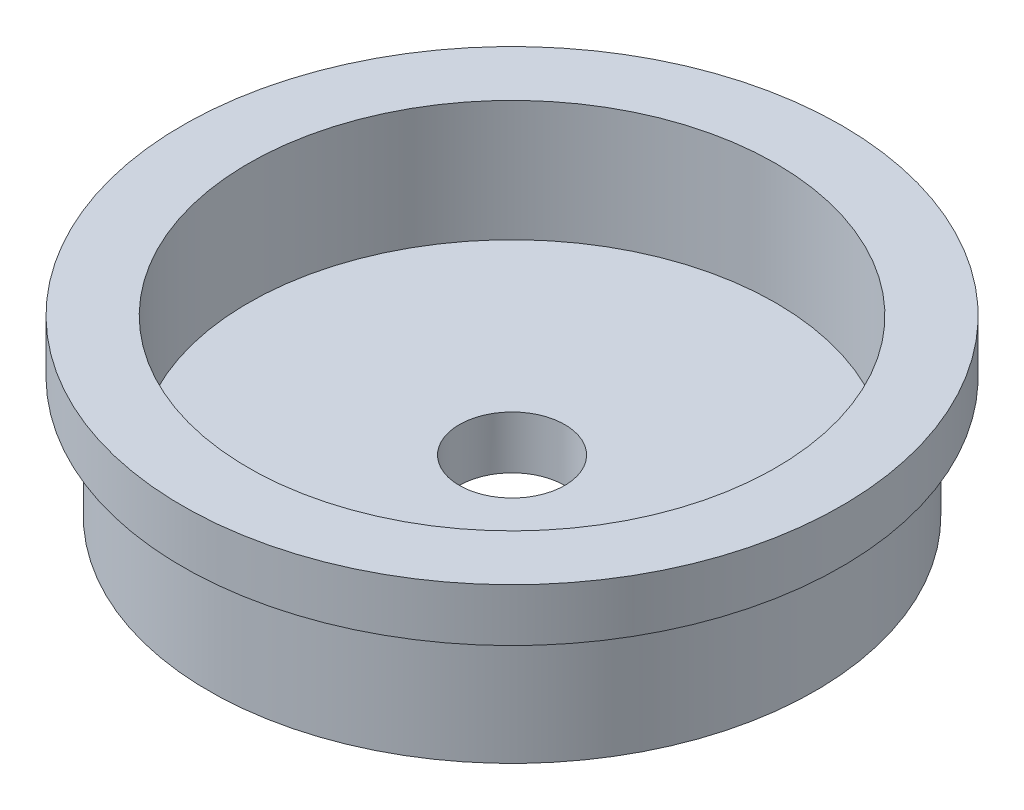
ISO-10303-21;
HEADER;
FILE_DESCRIPTION(('STEP AP214'),'2;1');
FILE_NAME('part.step','',(''),(''),'','','');
FILE_SCHEMA(('AUTOMOTIVE_DESIGN { 1 0 10303 214 1 1 1 1 }'));
ENDSEC;
DATA;
#1=APPLICATION_CONTEXT('core data for automotive mechanical design processes');
#2=APPLICATION_PROTOCOL_DEFINITION('international standard','automotive_design',2000,#1);
#3=PRODUCT_CONTEXT('',#1,'mechanical');
#4=PRODUCT('Part','Part','',(#3));
#5=PRODUCT_RELATED_PRODUCT_CATEGORY('part','',(#4));
#6=PRODUCT_DEFINITION_FORMATION('','',#4);
#7=PRODUCT_DEFINITION_CONTEXT('part definition',#1,'design');
#8=PRODUCT_DEFINITION('design','',#6,#7);
#9=PRODUCT_DEFINITION_SHAPE('','',#8);
#10=(LENGTH_UNIT() NAMED_UNIT(*) SI_UNIT(.MILLI.,.METRE.));
#11=(NAMED_UNIT(*) PLANE_ANGLE_UNIT() SI_UNIT($,.RADIAN.));
#12=(NAMED_UNIT(*) SI_UNIT($,.STERADIAN.) SOLID_ANGLE_UNIT());
#13=UNCERTAINTY_MEASURE_WITH_UNIT(LENGTH_MEASURE(1.E-05),#10,'distance_accuracy_value','');
#14=(GEOMETRIC_REPRESENTATION_CONTEXT(3) GLOBAL_UNCERTAINTY_ASSIGNED_CONTEXT((#13)) GLOBAL_UNIT_ASSIGNED_CONTEXT((#10,
#11,#12)) REPRESENTATION_CONTEXT('',''));
#15=CARTESIAN_POINT('',(0.,0.,0.));
#16=DIRECTION('',(0.,0.,1.));
#17=DIRECTION('',(1.,0.,0.));
#18=AXIS2_PLACEMENT_3D('',#15,#16,#17);
#19=CARTESIAN_POINT('',(0.,0.,0.));
#20=DIRECTION('',(0.,-1.,0.));
#21=DIRECTION('',(0.,0.,-1.));
#22=AXIS2_PLACEMENT_3D('',#19,#20,#21);
#23=PLANE('',#22);
#24=CARTESIAN_POINT('',(0.,0.,0.));
#25=DIRECTION('',(0.,-1.,0.));
#26=DIRECTION('',(0.,0.,-1.));
#27=AXIS2_PLACEMENT_3D('',#24,#25,#26);
#28=CIRCLE('',#27,1.);
#29=CARTESIAN_POINT('',(0.,0.,-1.));
#30=VERTEX_POINT('',#29);
#31=EDGE_CURVE('E36',#30,#30,#28,.T.);
#32=ORIENTED_EDGE('',*,*,#31,.F.);
#33=EDGE_LOOP('',(#32));
#34=FACE_BOUND('',#33,.T.);
#35=CARTESIAN_POINT('',(0.,0.,0.));
#36=DIRECTION('',(0.,-1.,0.));
#37=DIRECTION('',(0.,0.,-1.));
#38=AXIS2_PLACEMENT_3D('',#35,#36,#37);
#39=CIRCLE('',#38,5.75);
#40=CARTESIAN_POINT('',(0.,0.,-5.75));
#41=VERTEX_POINT('',#40);
#42=EDGE_CURVE('E10',#41,#41,#39,.T.);
#43=ORIENTED_EDGE('',*,*,#42,.T.);
#44=EDGE_LOOP('',(#43));
#45=FACE_BOUND('',#44,.T.);
#46=ADVANCED_FACE('F33',(#34,#45),#23,.T.);
#47=CARTESIAN_POINT('',(0.,0.,0.));
#48=DIRECTION('',(0.,-1.,0.));
#49=DIRECTION('',(0.,0.,-1.));
#50=AXIS2_PLACEMENT_3D('',#47,#48,#49);
#51=CYLINDRICAL_SURFACE('',#50,5.75);
#52=CARTESIAN_POINT('',(0.,2.,0.));
#53=DIRECTION('',(0.,-1.,0.));
#54=DIRECTION('',(0.,0.,-1.));
#55=AXIS2_PLACEMENT_3D('',#52,#53,#54);
#56=CIRCLE('',#55,5.75);
#57=CARTESIAN_POINT('',(0.,2.,-5.75));
#58=VERTEX_POINT('',#57);
#59=EDGE_CURVE('E40',#58,#58,#56,.T.);
#60=ORIENTED_EDGE('',*,*,#59,.T.);
#61=EDGE_LOOP('',(#60));
#62=FACE_BOUND('',#61,.T.);
#63=ORIENTED_EDGE('',*,*,#42,.F.);
#64=EDGE_LOOP('',(#63));
#65=FACE_BOUND('',#64,.T.);
#66=ADVANCED_FACE('F68',(#62,#65),#51,.T.);
#67=CARTESIAN_POINT('',(0.,2.,0.));
#68=DIRECTION('',(0.,1.,0.));
#69=DIRECTION('',(0.,0.,1.));
#70=AXIS2_PLACEMENT_3D('',#67,#68,#69);
#71=CONICAL_SURFACE('',#70,5.75,1.04670527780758);
#72=CARTESIAN_POINT('',(0.,2.28900341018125,0.));
#73=DIRECTION('',(0.,-1.,0.));
#74=DIRECTION('',(0.,0.,-1.));
#75=AXIS2_PLACEMENT_3D('',#72,#73,#74);
#76=CIRCLE('',#75,6.25);
#77=CARTESIAN_POINT('',(0.,2.28900341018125,-6.25));
#78=VERTEX_POINT('',#77);
#79=EDGE_CURVE('E44',#78,#78,#76,.T.);
#80=ORIENTED_EDGE('',*,*,#79,.T.);
#81=EDGE_LOOP('',(#80));
#82=FACE_BOUND('',#81,.T.);
#83=ORIENTED_EDGE('',*,*,#59,.F.);
#84=EDGE_LOOP('',(#83));
#85=FACE_BOUND('',#84,.T.);
#86=ADVANCED_FACE('F72',(#82,#85),#71,.T.);
#87=CARTESIAN_POINT('',(0.,0.,0.));
#88=DIRECTION('',(0.,-1.,0.));
#89=DIRECTION('',(0.,0.,-1.));
#90=AXIS2_PLACEMENT_3D('',#87,#88,#89);
#91=CYLINDRICAL_SURFACE('',#90,6.25);
#92=CARTESIAN_POINT('',(0.,3.28900341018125,0.));
#93=DIRECTION('',(0.,-1.,0.));
#94=DIRECTION('',(0.,0.,-1.));
#95=AXIS2_PLACEMENT_3D('',#92,#93,#94);
#96=CIRCLE('',#95,6.25);
#97=CARTESIAN_POINT('',(0.,3.28900341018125,-6.25));
#98=VERTEX_POINT('',#97);
#99=EDGE_CURVE('E49',#98,#98,#96,.T.);
#100=ORIENTED_EDGE('',*,*,#99,.T.);
#101=EDGE_LOOP('',(#100));
#102=FACE_BOUND('',#101,.T.);
#103=ORIENTED_EDGE('',*,*,#79,.F.);
#104=EDGE_LOOP('',(#103));
#105=FACE_BOUND('',#104,.T.);
#106=ADVANCED_FACE('F77',(#102,#105),#91,.T.);
#107=CARTESIAN_POINT('',(6.25,3.28900341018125,0.));
#108=DIRECTION('',(0.,1.,0.));
#109=DIRECTION('',(0.,0.,1.));
#110=AXIS2_PLACEMENT_3D('',#107,#108,#109);
#111=PLANE('',#110);
#112=CARTESIAN_POINT('',(0.,3.28900341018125,0.));
#113=DIRECTION('',(0.,-1.,0.));
#114=DIRECTION('',(0.,0.,-1.));
#115=AXIS2_PLACEMENT_3D('',#112,#113,#114);
#116=CIRCLE('',#115,5.);
#117=CARTESIAN_POINT('',(0.,3.28900341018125,-5.));
#118=VERTEX_POINT('',#117);
#119=EDGE_CURVE('E52',#118,#118,#116,.T.);
#120=ORIENTED_EDGE('',*,*,#119,.T.);
#121=EDGE_LOOP('',(#120));
#122=FACE_BOUND('',#121,.T.);
#123=ORIENTED_EDGE('',*,*,#99,.F.);
#124=EDGE_LOOP('',(#123));
#125=FACE_BOUND('',#124,.T.);
#126=ADVANCED_FACE('F84',(#122,#125),#111,.T.);
#127=CARTESIAN_POINT('',(0.,0.,0.));
#128=DIRECTION('',(0.,-1.,0.));
#129=DIRECTION('',(0.,0.,-1.));
#130=AXIS2_PLACEMENT_3D('',#127,#128,#129);
#131=CYLINDRICAL_SURFACE('',#130,5.);
#132=CARTESIAN_POINT('',(0.,1.,0.));
#133=DIRECTION('',(0.,-1.,0.));
#134=DIRECTION('',(0.,0.,-1.));
#135=AXIS2_PLACEMENT_3D('',#132,#133,#134);
#136=CIRCLE('',#135,5.);
#137=CARTESIAN_POINT('',(0.,1.,-5.));
#138=VERTEX_POINT('',#137);
#139=EDGE_CURVE('E55',#138,#138,#136,.T.);
#140=ORIENTED_EDGE('',*,*,#139,.T.);
#141=EDGE_LOOP('',(#140));
#142=FACE_BOUND('',#141,.T.);
#143=ORIENTED_EDGE('',*,*,#119,.F.);
#144=EDGE_LOOP('',(#143));
#145=FACE_BOUND('',#144,.T.);
#146=ADVANCED_FACE('F88',(#142,#145),#131,.F.);
#147=CARTESIAN_POINT('',(5.,1.,0.));
#148=DIRECTION('',(0.,1.,0.));
#149=DIRECTION('',(0.,0.,1.));
#150=AXIS2_PLACEMENT_3D('',#147,#148,#149);
#151=PLANE('',#150);
#152=CARTESIAN_POINT('',(0.,1.,0.));
#153=DIRECTION('',(0.,1.,0.));
#154=DIRECTION('',(0.,0.,1.));
#155=AXIS2_PLACEMENT_3D('',#152,#153,#154);
#156=CIRCLE('',#155,1.);
#157=CARTESIAN_POINT('',(0.,1.,1.));
#158=VERTEX_POINT('',#157);
#159=EDGE_CURVE('E58',#158,#158,#156,.T.);
#160=ORIENTED_EDGE('',*,*,#159,.F.);
#161=EDGE_LOOP('',(#160));
#162=FACE_BOUND('',#161,.T.);
#163=ORIENTED_EDGE('',*,*,#139,.F.);
#164=EDGE_LOOP('',(#163));
#165=FACE_BOUND('',#164,.T.);
#166=ADVANCED_FACE('F92',(#162,#165),#151,.T.);
#167=CARTESIAN_POINT('',(0.,-9.,0.));
#168=DIRECTION('',(0.,1.,0.));
#169=DIRECTION('',(0.,0.,1.));
#170=AXIS2_PLACEMENT_3D('',#167,#168,#169);
#171=CYLINDRICAL_SURFACE('',#170,1.);
#172=ORIENTED_EDGE('',*,*,#31,.T.);
#173=EDGE_LOOP('',(#172));
#174=FACE_BOUND('',#173,.T.);
#175=ORIENTED_EDGE('',*,*,#159,.T.);
#176=EDGE_LOOP('',(#175));
#177=FACE_BOUND('',#176,.T.);
#178=ADVANCED_FACE('F65',(#174,#177),#171,.F.);
#179=CLOSED_SHELL('',(#46,#66,#86,#106,#126,#146,#166,#178));
#180=MANIFOLD_SOLID_BREP('B2',#179);
#181=ADVANCED_BREP_SHAPE_REPRESENTATION('',(#18,#180),#14);
#182=SHAPE_DEFINITION_REPRESENTATION(#9,#181);
ENDSEC;
END-ISO-10303-21;
